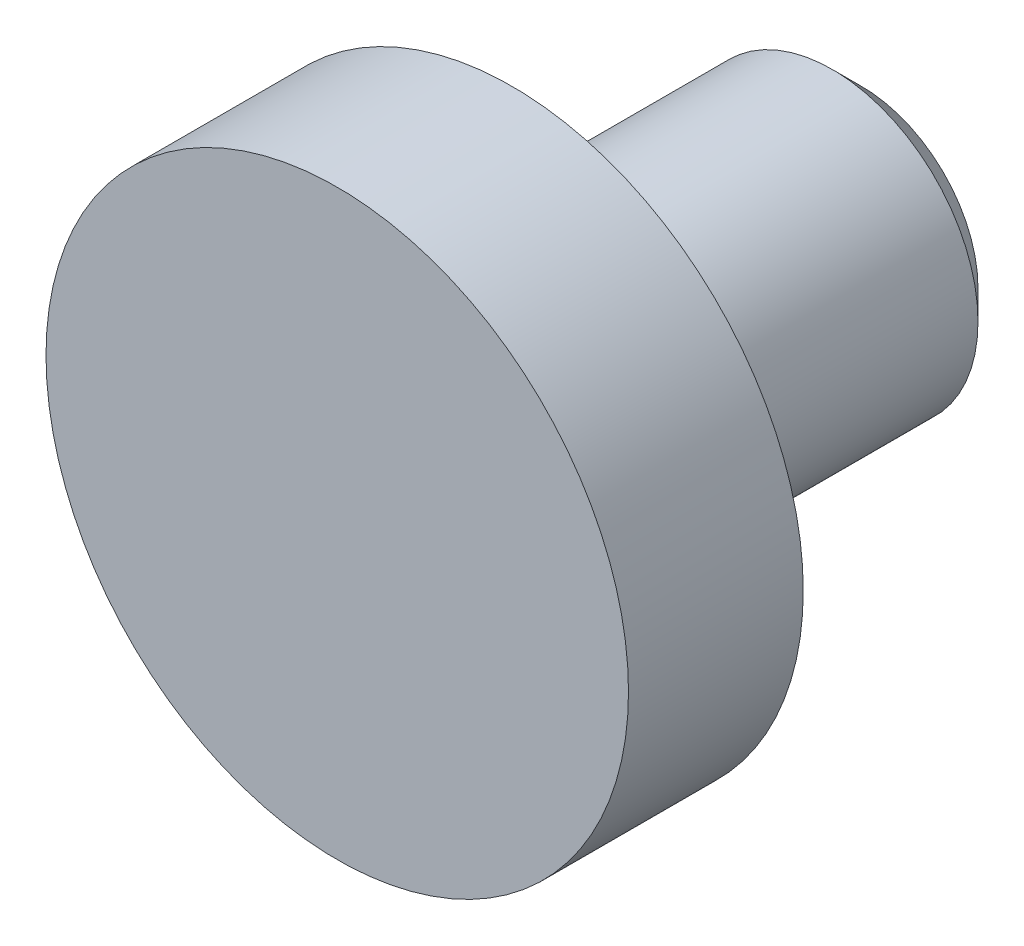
from build123d import *

# Parameters (mm, degrees)
ESQUISSE1_R        = 2.5
BOSS_EXTRU_1_DEPTH = 6
ESQUISSE2_R        = 5
BOSS_EXTRU_2_DEPTH = 3
CHANFREIN1_SIZE    = 0.5


with BuildPart() as part:
    # Esquisse1 → Boss.-Extru.1 (new body)
    with BuildSketch(Plane.XY):
        Circle(ESQUISSE1_R)
    extrude(amount=BOSS_EXTRU_1_DEPTH)

    # Esquisse2 → Boss.-Extru.2 (add)
    with BuildSketch(Plane.XY.offset(6)):
        Circle(ESQUISSE2_R)
    extrude(amount=BOSS_EXTRU_2_DEPTH)

    # Chanfrein1
    chanfrein1_edges = [part.edges().sort_by_distance(p)[0] for p in [
        (-2.5, 0, 0),
    ]]
    chamfer(chanfrein1_edges, length=CHANFREIN1_SIZE)


solid = part.part
